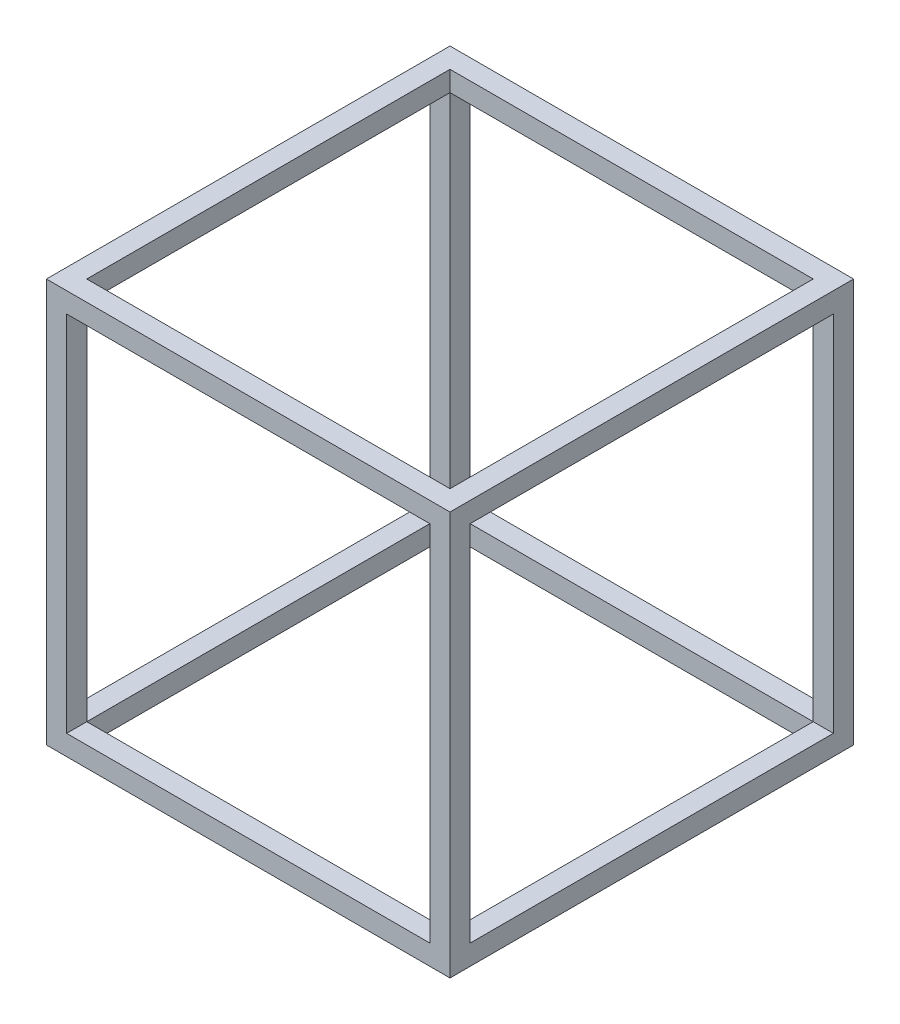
ISO-10303-21;
HEADER;
FILE_DESCRIPTION(('STEP AP214'),'2;1');
FILE_NAME('part.step','',(''),(''),'','','');
FILE_SCHEMA(('AUTOMOTIVE_DESIGN { 1 0 10303 214 1 1 1 1 }'));
ENDSEC;
DATA;
#1=APPLICATION_CONTEXT('core data for automotive mechanical design processes');
#2=APPLICATION_PROTOCOL_DEFINITION('international standard','automotive_design',2000,#1);
#3=PRODUCT_CONTEXT('',#1,'mechanical');
#4=PRODUCT('Part','Part','',(#3));
#5=PRODUCT_RELATED_PRODUCT_CATEGORY('part','',(#4));
#6=PRODUCT_DEFINITION_FORMATION('','',#4);
#7=PRODUCT_DEFINITION_CONTEXT('part definition',#1,'design');
#8=PRODUCT_DEFINITION('design','',#6,#7);
#9=PRODUCT_DEFINITION_SHAPE('','',#8);
#10=(LENGTH_UNIT() NAMED_UNIT(*) SI_UNIT(.MILLI.,.METRE.));
#11=(NAMED_UNIT(*) PLANE_ANGLE_UNIT() SI_UNIT($,.RADIAN.));
#12=(NAMED_UNIT(*) SI_UNIT($,.STERADIAN.) SOLID_ANGLE_UNIT());
#13=UNCERTAINTY_MEASURE_WITH_UNIT(LENGTH_MEASURE(1.E-05),#10,'distance_accuracy_value','');
#14=(GEOMETRIC_REPRESENTATION_CONTEXT(3) GLOBAL_UNCERTAINTY_ASSIGNED_CONTEXT((#13)) GLOBAL_UNIT_ASSIGNED_CONTEXT((#10,
#11,#12)) REPRESENTATION_CONTEXT('',''));
#15=CARTESIAN_POINT('',(0.,0.,0.));
#16=DIRECTION('',(0.,0.,1.));
#17=DIRECTION('',(1.,0.,0.));
#18=AXIS2_PLACEMENT_3D('',#15,#16,#17);
#19=CARTESIAN_POINT('',(0.,2.,-40.));
#20=DIRECTION('',(0.,-1.,0.));
#21=DIRECTION('',(0.,0.,-1.));
#22=AXIS2_PLACEMENT_3D('',#19,#20,#21);
#23=PLANE('',#22);
#24=DIRECTION('',(-1.,0.,0.));
#25=VECTOR('',#24,1.);
#26=CARTESIAN_POINT('',(2.,2.,-1.99999999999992));
#27=LINE('',#26,#25);
#28=CARTESIAN_POINT('',(2.,2.,-2.));
#29=VERTEX_POINT('',#28);
#30=CARTESIAN_POINT('',(0.,2.,-1.99999999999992));
#31=VERTEX_POINT('',#30);
#32=EDGE_CURVE('E223',#29,#31,#27,.T.);
#33=ORIENTED_EDGE('',*,*,#32,.F.);
#34=DIRECTION('',(0.,0.,-1.));
#35=VECTOR('',#34,1.);
#36=CARTESIAN_POINT('',(2.,2.,-38.));
#37=LINE('',#36,#35);
#38=CARTESIAN_POINT('',(2.,2.,-38.));
#39=VERTEX_POINT('',#38);
#40=EDGE_CURVE('E199',#29,#39,#37,.T.);
#41=ORIENTED_EDGE('',*,*,#40,.T.);
#42=DIRECTION('',(-1.,0.,0.));
#43=VECTOR('',#42,1.);
#44=CARTESIAN_POINT('',(2.,2.,-38.0000000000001));
#45=LINE('',#44,#43);
#46=CARTESIAN_POINT('',(0.,2.,-38.0000000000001));
#47=VERTEX_POINT('',#46);
#48=EDGE_CURVE('E221',#39,#47,#45,.T.);
#49=ORIENTED_EDGE('',*,*,#48,.T.);
#50=DIRECTION('',(0.,0.,1.));
#51=VECTOR('',#50,1.);
#52=CARTESIAN_POINT('',(0.,2.,-38.0000000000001));
#53=LINE('',#52,#51);
#54=EDGE_CURVE('E411',#47,#31,#53,.T.);
#55=ORIENTED_EDGE('',*,*,#54,.T.);
#56=EDGE_LOOP('',(#33,#41,#49,#55));
#57=FACE_BOUND('',#56,.T.);
#58=ADVANCED_FACE('F59',(#57),#23,.F.);
#59=DIRECTION('',(0.,0.,1.));
#60=VECTOR('',#59,1.);
#61=CARTESIAN_POINT('',(38.,2.,-40.));
#62=LINE('',#61,#60);
#63=CARTESIAN_POINT('',(38.,2.,-2.));
#64=VERTEX_POINT('',#63);
#65=CARTESIAN_POINT('',(38.,2.,0.));
#66=VERTEX_POINT('',#65);
#67=EDGE_CURVE('E251',#64,#66,#62,.T.);
#68=ORIENTED_EDGE('',*,*,#67,.F.);
#69=DIRECTION('',(-1.,0.,0.));
#70=VECTOR('',#69,1.);
#71=CARTESIAN_POINT('',(38.,2.,-2.));
#72=LINE('',#71,#70);
#73=EDGE_CURVE('E205',#64,#29,#72,.T.);
#74=ORIENTED_EDGE('',*,*,#73,.T.);
#75=DIRECTION('',(0.,0.,1.));
#76=VECTOR('',#75,1.);
#77=CARTESIAN_POINT('',(2.,2.,-40.));
#78=LINE('',#77,#76);
#79=CARTESIAN_POINT('',(2.,2.,0.));
#80=VERTEX_POINT('',#79);
#81=EDGE_CURVE('E252',#29,#80,#78,.T.);
#82=ORIENTED_EDGE('',*,*,#81,.T.);
#83=DIRECTION('',(1.,0.,0.));
#84=VECTOR('',#83,1.);
#85=CARTESIAN_POINT('',(0.,2.,0.));
#86=LINE('',#85,#84);
#87=EDGE_CURVE('E378',#80,#66,#86,.T.);
#88=ORIENTED_EDGE('',*,*,#87,.T.);
#89=EDGE_LOOP('',(#68,#74,#82,#88));
#90=FACE_BOUND('',#89,.T.);
#91=ADVANCED_FACE('F315',(#90),#23,.F.);
#92=DIRECTION('',(1.,0.,0.));
#93=VECTOR('',#92,1.);
#94=CARTESIAN_POINT('',(38.,2.00000000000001,-38.));
#95=LINE('',#94,#93);
#96=CARTESIAN_POINT('',(38.,2.,-38.));
#97=VERTEX_POINT('',#96);
#98=CARTESIAN_POINT('',(40.,2.00000000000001,-38.));
#99=VERTEX_POINT('',#98);
#100=EDGE_CURVE('E349',#97,#99,#95,.T.);
#101=ORIENTED_EDGE('',*,*,#100,.F.);
#102=DIRECTION('',(0.,0.,1.));
#103=VECTOR('',#102,1.);
#104=CARTESIAN_POINT('',(38.,2.,-38.));
#105=LINE('',#104,#103);
#106=EDGE_CURVE('E215',#97,#64,#105,.T.);
#107=ORIENTED_EDGE('',*,*,#106,.T.);
#108=DIRECTION('',(1.,0.,0.));
#109=VECTOR('',#108,1.);
#110=CARTESIAN_POINT('',(38.,2.00000000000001,-1.99999999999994));
#111=LINE('',#110,#109);
#112=CARTESIAN_POINT('',(40.,2.00000000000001,-1.99999999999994));
#113=VERTEX_POINT('',#112);
#114=EDGE_CURVE('E355',#64,#113,#111,.T.);
#115=ORIENTED_EDGE('',*,*,#114,.T.);
#116=DIRECTION('',(0.,0.,-1.));
#117=VECTOR('',#116,1.);
#118=CARTESIAN_POINT('',(40.,2.00000000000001,-1.99999999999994));
#119=LINE('',#118,#117);
#120=EDGE_CURVE('E353',#113,#99,#119,.T.);
#121=ORIENTED_EDGE('',*,*,#120,.T.);
#122=EDGE_LOOP('',(#101,#107,#115,#121));
#123=FACE_BOUND('',#122,.T.);
#124=ADVANCED_FACE('F320',(#123),#23,.F.);
#125=CARTESIAN_POINT('',(0.,38.,-40.));
#126=DIRECTION('',(0.,1.,0.));
#127=DIRECTION('',(0.,0.,1.));
#128=AXIS2_PLACEMENT_3D('',#125,#126,#127);
#129=PLANE('',#128);
#130=DIRECTION('',(-1.,0.,0.));
#131=VECTOR('',#130,1.);
#132=CARTESIAN_POINT('',(2.,38.,-38.0000000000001));
#133=LINE('',#132,#131);
#134=CARTESIAN_POINT('',(1.99999999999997,38.,-38.));
#135=VERTEX_POINT('',#134);
#136=CARTESIAN_POINT('',(0.,38.,-38.0000000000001));
#137=VERTEX_POINT('',#136);
#138=EDGE_CURVE('E236',#135,#137,#133,.T.);
#139=ORIENTED_EDGE('',*,*,#138,.F.);
#140=DIRECTION('',(0.,0.,1.));
#141=VECTOR('',#140,1.);
#142=CARTESIAN_POINT('',(1.99999999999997,38.,-38.));
#143=LINE('',#142,#141);
#144=CARTESIAN_POINT('',(1.99999999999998,38.,-2.00000000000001));
#145=VERTEX_POINT('',#144);
#146=EDGE_CURVE('E433',#135,#145,#143,.T.);
#147=ORIENTED_EDGE('',*,*,#146,.T.);
#148=DIRECTION('',(-1.,0.,0.));
#149=VECTOR('',#148,1.);
#150=CARTESIAN_POINT('',(2.,38.,-1.99999999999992));
#151=LINE('',#150,#149);
#152=CARTESIAN_POINT('',(0.,38.,-1.99999999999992));
#153=VERTEX_POINT('',#152);
#154=EDGE_CURVE('E244',#145,#153,#151,.T.);
#155=ORIENTED_EDGE('',*,*,#154,.T.);
#156=DIRECTION('',(0.,0.,-1.));
#157=VECTOR('',#156,1.);
#158=CARTESIAN_POINT('',(0.,38.,-38.0000000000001));
#159=LINE('',#158,#157);
#160=EDGE_CURVE('E414',#153,#137,#159,.T.);
#161=ORIENTED_EDGE('',*,*,#160,.T.);
#162=EDGE_LOOP('',(#139,#147,#155,#161));
#163=FACE_BOUND('',#162,.T.);
#164=ADVANCED_FACE('F338',(#163),#129,.F.);
#165=DIRECTION('',(0.,0.,1.));
#166=VECTOR('',#165,1.);
#167=CARTESIAN_POINT('',(38.,38.,-40.));
#168=LINE('',#167,#166);
#169=CARTESIAN_POINT('',(38.,38.,-40.));
#170=VERTEX_POINT('',#169);
#171=CARTESIAN_POINT('',(38.,38.,-38.));
#172=VERTEX_POINT('',#171);
#173=EDGE_CURVE('E364',#170,#172,#168,.T.);
#174=ORIENTED_EDGE('',*,*,#173,.T.);
#175=DIRECTION('',(-1.,0.,0.));
#176=VECTOR('',#175,1.);
#177=CARTESIAN_POINT('',(38.,38.,-38.));
#178=LINE('',#177,#176);
#179=EDGE_CURVE('E425',#172,#135,#178,.T.);
#180=ORIENTED_EDGE('',*,*,#179,.T.);
#181=DIRECTION('',(0.,0.,1.));
#182=VECTOR('',#181,1.);
#183=CARTESIAN_POINT('',(2.,38.,-40.));
#184=LINE('',#183,#182);
#185=CARTESIAN_POINT('',(2.,38.,-40.));
#186=VERTEX_POINT('',#185);
#187=EDGE_CURVE('E243',#186,#135,#184,.T.);
#188=ORIENTED_EDGE('',*,*,#187,.F.);
#189=DIRECTION('',(-1.,0.,0.));
#190=VECTOR('',#189,1.);
#191=CARTESIAN_POINT('',(0.,38.,-40.));
#192=LINE('',#191,#190);
#193=EDGE_CURVE('E256',#170,#186,#192,.T.);
#194=ORIENTED_EDGE('',*,*,#193,.F.);
#195=EDGE_LOOP('',(#174,#180,#188,#194));
#196=FACE_BOUND('',#195,.T.);
#197=ADVANCED_FACE('F343',(#196),#129,.F.);
#198=DIRECTION('',(1.,0.,0.));
#199=VECTOR('',#198,1.);
#200=CARTESIAN_POINT('',(38.,38.,-1.99999999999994));
#201=LINE('',#200,#199);
#202=CARTESIAN_POINT('',(38.,38.,-1.99999999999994));
#203=VERTEX_POINT('',#202);
#204=CARTESIAN_POINT('',(40.,38.,-1.99999999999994));
#205=VERTEX_POINT('',#204);
#206=EDGE_CURVE('E391',#203,#205,#201,.T.);
#207=ORIENTED_EDGE('',*,*,#206,.F.);
#208=DIRECTION('',(0.,0.,-1.));
#209=VECTOR('',#208,1.);
#210=CARTESIAN_POINT('',(38.,38.,-38.));
#211=LINE('',#210,#209);
#212=EDGE_CURVE('E444',#203,#172,#211,.T.);
#213=ORIENTED_EDGE('',*,*,#212,.T.);
#214=DIRECTION('',(1.,0.,0.));
#215=VECTOR('',#214,1.);
#216=CARTESIAN_POINT('',(38.,38.,-38.));
#217=LINE('',#216,#215);
#218=CARTESIAN_POINT('',(40.,38.,-38.));
#219=VERTEX_POINT('',#218);
#220=EDGE_CURVE('E388',#172,#219,#217,.T.);
#221=ORIENTED_EDGE('',*,*,#220,.T.);
#222=DIRECTION('',(0.,0.,1.));
#223=VECTOR('',#222,1.);
#224=CARTESIAN_POINT('',(40.,38.,-1.99999999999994));
#225=LINE('',#224,#223);
#226=EDGE_CURVE('E399',#219,#205,#225,.T.);
#227=ORIENTED_EDGE('',*,*,#226,.T.);
#228=EDGE_LOOP('',(#207,#213,#221,#227));
#229=FACE_BOUND('',#228,.T.);
#230=ADVANCED_FACE('F487',(#229),#129,.F.);
#231=CARTESIAN_POINT('',(2.,0.,-40.));
#232=DIRECTION('',(-1.,0.,0.));
#233=DIRECTION('',(0.,0.,1.));
#234=AXIS2_PLACEMENT_3D('',#231,#232,#233);
#235=PLANE('',#234);
#236=ORIENTED_EDGE('',*,*,#81,.F.);
#237=DIRECTION('',(0.,1.,0.));
#238=VECTOR('',#237,1.);
#239=CARTESIAN_POINT('',(2.,2.,-1.99999999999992));
#240=LINE('',#239,#238);
#241=EDGE_CURVE('E245',#29,#145,#240,.T.);
#242=ORIENTED_EDGE('',*,*,#241,.T.);
#243=CARTESIAN_POINT('',(2.,38.,0.));
#244=VERTEX_POINT('',#243);
#245=EDGE_CURVE('E370',#145,#244,#184,.T.);
#246=ORIENTED_EDGE('',*,*,#245,.T.);
#247=DIRECTION('',(0.,-1.,0.));
#248=VECTOR('',#247,1.);
#249=CARTESIAN_POINT('',(2.,0.,0.));
#250=LINE('',#249,#248);
#251=EDGE_CURVE('E354',#244,#80,#250,.T.);
#252=ORIENTED_EDGE('',*,*,#251,.T.);
#253=EDGE_LOOP('',(#236,#242,#246,#252));
#254=FACE_BOUND('',#253,.T.);
#255=ADVANCED_FACE('F473',(#254),#235,.F.);
#256=CARTESIAN_POINT('',(38.,0.,-40.));
#257=DIRECTION('',(1.,0.,0.));
#258=DIRECTION('',(0.,0.,-1.));
#259=AXIS2_PLACEMENT_3D('',#256,#257,#258);
#260=PLANE('',#259);
#261=CARTESIAN_POINT('',(38.,2.,-40.));
#262=VERTEX_POINT('',#261);
#263=EDGE_CURVE('E254',#262,#97,#62,.T.);
#264=ORIENTED_EDGE('',*,*,#263,.T.);
#265=DIRECTION('',(0.,1.,0.));
#266=VECTOR('',#265,1.);
#267=CARTESIAN_POINT('',(38.,2.00000000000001,-38.));
#268=LINE('',#267,#266);
#269=EDGE_CURVE('E359',#97,#172,#268,.T.);
#270=ORIENTED_EDGE('',*,*,#269,.T.);
#271=ORIENTED_EDGE('',*,*,#173,.F.);
#272=DIRECTION('',(0.,1.,0.));
#273=VECTOR('',#272,1.);
#274=CARTESIAN_POINT('',(38.,0.,-40.));
#275=LINE('',#274,#273);
#276=EDGE_CURVE('E362',#262,#170,#275,.T.);
#277=ORIENTED_EDGE('',*,*,#276,.F.);
#278=EDGE_LOOP('',(#264,#270,#271,#277));
#279=FACE_BOUND('',#278,.T.);
#280=ADVANCED_FACE('F336',(#279),#260,.F.);
#281=CARTESIAN_POINT('',(0.,0.,-40.));
#282=DIRECTION('',(-1.,0.,0.));
#283=DIRECTION('',(0.,0.,1.));
#284=AXIS2_PLACEMENT_3D('',#281,#282,#283);
#285=PLANE('',#284);
#286=DIRECTION('',(0.,1.,0.));
#287=VECTOR('',#286,1.);
#288=CARTESIAN_POINT('',(0.,2.,-1.99999999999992));
#289=LINE('',#288,#287);
#290=EDGE_CURVE('E417',#31,#153,#289,.T.);
#291=ORIENTED_EDGE('',*,*,#290,.F.);
#292=ORIENTED_EDGE('',*,*,#54,.F.);
#293=DIRECTION('',(0.,-1.,0.));
#294=VECTOR('',#293,1.);
#295=CARTESIAN_POINT('',(0.,2.,-38.0000000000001));
#296=LINE('',#295,#294);
#297=EDGE_CURVE('E234',#137,#47,#296,.T.);
#298=ORIENTED_EDGE('',*,*,#297,.F.);
#299=ORIENTED_EDGE('',*,*,#160,.F.);
#300=EDGE_LOOP('',(#291,#292,#298,#299));
#301=FACE_BOUND('',#300,.T.);
#302=DIRECTION('',(0.,-1.,0.));
#303=VECTOR('',#302,1.);
#304=CARTESIAN_POINT('',(0.,0.,0.));
#305=LINE('',#304,#303);
#306=CARTESIAN_POINT('',(0.,40.,0.));
#307=VERTEX_POINT('',#306);
#308=CARTESIAN_POINT('',(0.,0.,0.));
#309=VERTEX_POINT('',#308);
#310=EDGE_CURVE('E272',#307,#309,#305,.T.);
#311=ORIENTED_EDGE('',*,*,#310,.F.);
#312=DIRECTION('',(0.,0.,1.));
#313=VECTOR('',#312,1.);
#314=CARTESIAN_POINT('',(0.,40.,-40.));
#315=LINE('',#314,#313);
#316=CARTESIAN_POINT('',(0.,40.,-40.));
#317=VERTEX_POINT('',#316);
#318=EDGE_CURVE('E12',#317,#307,#315,.T.);
#319=ORIENTED_EDGE('',*,*,#318,.F.);
#320=DIRECTION('',(0.,-1.,0.));
#321=VECTOR('',#320,1.);
#322=CARTESIAN_POINT('',(0.,0.,-40.));
#323=LINE('',#322,#321);
#324=CARTESIAN_POINT('',(0.,0.,-40.));
#325=VERTEX_POINT('',#324);
#326=EDGE_CURVE('E259',#317,#325,#323,.T.);
#327=ORIENTED_EDGE('',*,*,#326,.T.);
#328=DIRECTION('',(0.,0.,1.));
#329=VECTOR('',#328,1.);
#330=CARTESIAN_POINT('',(0.,0.,-40.));
#331=LINE('',#330,#329);
#332=EDGE_CURVE('E63',#325,#309,#331,.T.);
#333=ORIENTED_EDGE('',*,*,#332,.T.);
#334=EDGE_LOOP('',(#311,#319,#327,#333));
#335=FACE_BOUND('',#334,.T.);
#336=ADVANCED_FACE('F61',(#301,#335),#285,.T.);
#337=CARTESIAN_POINT('',(0.,40.,-40.));
#338=DIRECTION('',(0.,1.,0.));
#339=DIRECTION('',(0.,0.,1.));
#340=AXIS2_PLACEMENT_3D('',#337,#338,#339);
#341=PLANE('',#340);
#342=DIRECTION('',(0.,0.,1.));
#343=VECTOR('',#342,1.);
#344=CARTESIAN_POINT('',(1.99999999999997,40.,-38.));
#345=LINE('',#344,#343);
#346=CARTESIAN_POINT('',(1.99999999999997,40.,-38.));
#347=VERTEX_POINT('',#346);
#348=CARTESIAN_POINT('',(1.99999999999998,40.,-2.));
#349=VERTEX_POINT('',#348);
#350=EDGE_CURVE('E84',#347,#349,#345,.T.);
#351=ORIENTED_EDGE('',*,*,#350,.F.);
#352=DIRECTION('',(-1.,0.,0.));
#353=VECTOR('',#352,1.);
#354=CARTESIAN_POINT('',(38.,40.,-38.));
#355=LINE('',#354,#353);
#356=CARTESIAN_POINT('',(38.,40.,-38.));
#357=VERTEX_POINT('',#356);
#358=EDGE_CURVE('E430',#357,#347,#355,.T.);
#359=ORIENTED_EDGE('',*,*,#358,.F.);
#360=DIRECTION('',(0.,0.,-1.));
#361=VECTOR('',#360,1.);
#362=CARTESIAN_POINT('',(38.,40.,-38.));
#363=LINE('',#362,#361);
#364=CARTESIAN_POINT('',(38.,40.,-2.00000000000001));
#365=VERTEX_POINT('',#364);
#366=EDGE_CURVE('E434',#365,#357,#363,.T.);
#367=ORIENTED_EDGE('',*,*,#366,.F.);
#368=DIRECTION('',(1.,0.,0.));
#369=VECTOR('',#368,1.);
#370=CARTESIAN_POINT('',(38.,40.,-2.00000000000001));
#371=LINE('',#370,#369);
#372=EDGE_CURVE('E437',#349,#365,#371,.T.);
#373=ORIENTED_EDGE('',*,*,#372,.F.);
#374=EDGE_LOOP('',(#351,#359,#367,#373));
#375=FACE_BOUND('',#374,.T.);
#376=DIRECTION('',(-1.,0.,0.));
#377=VECTOR('',#376,1.);
#378=CARTESIAN_POINT('',(0.,40.,0.));
#379=LINE('',#378,#377);
#380=CARTESIAN_POINT('',(40.,40.,0.));
#381=VERTEX_POINT('',#380);
#382=EDGE_CURVE('E263',#381,#307,#379,.T.);
#383=ORIENTED_EDGE('',*,*,#382,.F.);
#384=DIRECTION('',(0.,0.,1.));
#385=VECTOR('',#384,1.);
#386=CARTESIAN_POINT('',(40.,40.,-40.));
#387=LINE('',#386,#385);
#388=CARTESIAN_POINT('',(40.,40.,-40.));
#389=VERTEX_POINT('',#388);
#390=EDGE_CURVE('E68',#389,#381,#387,.T.);
#391=ORIENTED_EDGE('',*,*,#390,.F.);
#392=DIRECTION('',(-1.,0.,0.));
#393=VECTOR('',#392,1.);
#394=CARTESIAN_POINT('',(0.,40.,-40.));
#395=LINE('',#394,#393);
#396=EDGE_CURVE('E269',#389,#317,#395,.T.);
#397=ORIENTED_EDGE('',*,*,#396,.T.);
#398=ORIENTED_EDGE('',*,*,#318,.T.);
#399=EDGE_LOOP('',(#383,#391,#397,#398));
#400=FACE_BOUND('',#399,.T.);
#401=ADVANCED_FACE('F296',(#375,#400),#341,.T.);
#402=CARTESIAN_POINT('',(40.,0.,-40.));
#403=DIRECTION('',(1.,0.,0.));
#404=DIRECTION('',(0.,0.,-1.));
#405=AXIS2_PLACEMENT_3D('',#402,#403,#404);
#406=PLANE('',#405);
#407=DIRECTION('',(0.,1.,0.));
#408=VECTOR('',#407,1.);
#409=CARTESIAN_POINT('',(40.,2.00000000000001,-38.));
#410=LINE('',#409,#408);
#411=EDGE_CURVE('E402',#99,#219,#410,.T.);
#412=ORIENTED_EDGE('',*,*,#411,.F.);
#413=ORIENTED_EDGE('',*,*,#120,.F.);
#414=DIRECTION('',(0.,-1.,0.));
#415=VECTOR('',#414,1.);
#416=CARTESIAN_POINT('',(40.,2.00000000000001,-1.99999999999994));
#417=LINE('',#416,#415);
#418=EDGE_CURVE('E396',#205,#113,#417,.T.);
#419=ORIENTED_EDGE('',*,*,#418,.F.);
#420=ORIENTED_EDGE('',*,*,#226,.F.);
#421=EDGE_LOOP('',(#412,#413,#419,#420));
#422=FACE_BOUND('',#421,.T.);
#423=DIRECTION('',(0.,1.,0.));
#424=VECTOR('',#423,1.);
#425=CARTESIAN_POINT('',(40.,0.,0.));
#426=LINE('',#425,#424);
#427=CARTESIAN_POINT('',(40.,0.,0.));
#428=VERTEX_POINT('',#427);
#429=EDGE_CURVE('E278',#428,#381,#426,.T.);
#430=ORIENTED_EDGE('',*,*,#429,.F.);
#431=DIRECTION('',(0.,0.,1.));
#432=VECTOR('',#431,1.);
#433=CARTESIAN_POINT('',(40.,0.,-40.));
#434=LINE('',#433,#432);
#435=CARTESIAN_POINT('',(40.,0.,-40.));
#436=VERTEX_POINT('',#435);
#437=EDGE_CURVE('E283',#436,#428,#434,.T.);
#438=ORIENTED_EDGE('',*,*,#437,.F.);
#439=DIRECTION('',(0.,1.,0.));
#440=VECTOR('',#439,1.);
#441=CARTESIAN_POINT('',(40.,0.,-40.));
#442=LINE('',#441,#440);
#443=EDGE_CURVE('E266',#436,#389,#442,.T.);
#444=ORIENTED_EDGE('',*,*,#443,.T.);
#445=ORIENTED_EDGE('',*,*,#390,.T.);
#446=EDGE_LOOP('',(#430,#438,#444,#445));
#447=FACE_BOUND('',#446,.T.);
#448=ADVANCED_FACE('F302',(#422,#447),#406,.T.);
#449=CARTESIAN_POINT('',(0.,0.,-40.));
#450=DIRECTION('',(0.,-1.,0.));
#451=DIRECTION('',(0.,0.,-1.));
#452=AXIS2_PLACEMENT_3D('',#449,#450,#451);
#453=PLANE('',#452);
#454=DIRECTION('',(0.,0.,-1.));
#455=VECTOR('',#454,1.);
#456=CARTESIAN_POINT('',(2.,0.,-38.));
#457=LINE('',#456,#455);
#458=CARTESIAN_POINT('',(2.,0.,-2.));
#459=VERTEX_POINT('',#458);
#460=CARTESIAN_POINT('',(2.,0.,-38.));
#461=VERTEX_POINT('',#460);
#462=EDGE_CURVE('E76',#459,#461,#457,.T.);
#463=ORIENTED_EDGE('',*,*,#462,.F.);
#464=DIRECTION('',(-1.,0.,0.));
#465=VECTOR('',#464,1.);
#466=CARTESIAN_POINT('',(38.,0.,-2.));
#467=LINE('',#466,#465);
#468=CARTESIAN_POINT('',(38.,0.,-2.));
#469=VERTEX_POINT('',#468);
#470=EDGE_CURVE('E225',#469,#459,#467,.T.);
#471=ORIENTED_EDGE('',*,*,#470,.F.);
#472=DIRECTION('',(0.,0.,1.));
#473=VECTOR('',#472,1.);
#474=CARTESIAN_POINT('',(38.,0.,-38.));
#475=LINE('',#474,#473);
#476=CARTESIAN_POINT('',(38.,0.,-38.));
#477=VERTEX_POINT('',#476);
#478=EDGE_CURVE('E457',#477,#469,#475,.T.);
#479=ORIENTED_EDGE('',*,*,#478,.F.);
#480=DIRECTION('',(1.,0.,0.));
#481=VECTOR('',#480,1.);
#482=CARTESIAN_POINT('',(38.,0.,-38.));
#483=LINE('',#482,#481);
#484=EDGE_CURVE('E460',#461,#477,#483,.T.);
#485=ORIENTED_EDGE('',*,*,#484,.F.);
#486=EDGE_LOOP('',(#463,#471,#479,#485));
#487=FACE_BOUND('',#486,.T.);
#488=DIRECTION('',(1.,0.,0.));
#489=VECTOR('',#488,1.);
#490=CARTESIAN_POINT('',(0.,0.,0.));
#491=LINE('',#490,#489);
#492=EDGE_CURVE('E275',#309,#428,#491,.T.);
#493=ORIENTED_EDGE('',*,*,#492,.F.);
#494=ORIENTED_EDGE('',*,*,#332,.F.);
#495=DIRECTION('',(1.,0.,0.));
#496=VECTOR('',#495,1.);
#497=CARTESIAN_POINT('',(0.,0.,-40.));
#498=LINE('',#497,#496);
#499=EDGE_CURVE('E262',#325,#436,#498,.T.);
#500=ORIENTED_EDGE('',*,*,#499,.T.);
#501=ORIENTED_EDGE('',*,*,#437,.T.);
#502=EDGE_LOOP('',(#493,#494,#500,#501));
#503=FACE_BOUND('',#502,.T.);
#504=ADVANCED_FACE('F291',(#487,#503),#453,.T.);
#505=CARTESIAN_POINT('',(0.,0.,-40.));
#506=DIRECTION('',(0.,0.,1.));
#507=DIRECTION('',(1.,0.,0.));
#508=AXIS2_PLACEMENT_3D('',#505,#506,#507);
#509=PLANE('',#508);
#510=ORIENTED_EDGE('',*,*,#193,.T.);
#511=DIRECTION('',(0.,-1.,0.));
#512=VECTOR('',#511,1.);
#513=CARTESIAN_POINT('',(2.,0.,-40.));
#514=LINE('',#513,#512);
#515=CARTESIAN_POINT('',(2.,2.,-40.));
#516=VERTEX_POINT('',#515);
#517=EDGE_CURVE('E375',#186,#516,#514,.T.);
#518=ORIENTED_EDGE('',*,*,#517,.T.);
#519=DIRECTION('',(1.,0.,0.));
#520=VECTOR('',#519,1.);
#521=CARTESIAN_POINT('',(0.,2.,-40.));
#522=LINE('',#521,#520);
#523=EDGE_CURVE('E249',#516,#262,#522,.T.);
#524=ORIENTED_EDGE('',*,*,#523,.T.);
#525=ORIENTED_EDGE('',*,*,#276,.T.);
#526=EDGE_LOOP('',(#510,#518,#524,#525));
#527=FACE_BOUND('',#526,.T.);
#528=ORIENTED_EDGE('',*,*,#326,.F.);
#529=ORIENTED_EDGE('',*,*,#396,.F.);
#530=ORIENTED_EDGE('',*,*,#443,.F.);
#531=ORIENTED_EDGE('',*,*,#499,.F.);
#532=EDGE_LOOP('',(#528,#529,#530,#531));
#533=FACE_BOUND('',#532,.T.);
#534=ADVANCED_FACE('F299',(#527,#533),#509,.F.);
#535=CARTESIAN_POINT('',(0.,0.,0.));
#536=DIRECTION('',(0.,0.,1.));
#537=DIRECTION('',(1.,0.,0.));
#538=AXIS2_PLACEMENT_3D('',#535,#536,#537);
#539=PLANE('',#538);
#540=ORIENTED_EDGE('',*,*,#251,.F.);
#541=DIRECTION('',(-1.,0.,0.));
#542=VECTOR('',#541,1.);
#543=CARTESIAN_POINT('',(0.,38.,0.));
#544=LINE('',#543,#542);
#545=CARTESIAN_POINT('',(38.,38.,0.));
#546=VERTEX_POINT('',#545);
#547=EDGE_CURVE('E373',#546,#244,#544,.T.);
#548=ORIENTED_EDGE('',*,*,#547,.F.);
#549=DIRECTION('',(0.,1.,0.));
#550=VECTOR('',#549,1.);
#551=CARTESIAN_POINT('',(38.,0.,0.));
#552=LINE('',#551,#550);
#553=EDGE_CURVE('E376',#66,#546,#552,.T.);
#554=ORIENTED_EDGE('',*,*,#553,.F.);
#555=ORIENTED_EDGE('',*,*,#87,.F.);
#556=EDGE_LOOP('',(#540,#548,#554,#555));
#557=FACE_BOUND('',#556,.T.);
#558=ORIENTED_EDGE('',*,*,#310,.T.);
#559=ORIENTED_EDGE('',*,*,#492,.T.);
#560=ORIENTED_EDGE('',*,*,#429,.T.);
#561=ORIENTED_EDGE('',*,*,#382,.T.);
#562=EDGE_LOOP('',(#558,#559,#560,#561));
#563=FACE_BOUND('',#562,.T.);
#564=ADVANCED_FACE('F293',(#557,#563),#539,.T.);
#565=ORIENTED_EDGE('',*,*,#187,.T.);
#566=DIRECTION('',(0.,-1.,0.));
#567=VECTOR('',#566,1.);
#568=CARTESIAN_POINT('',(2.,2.,-38.0000000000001));
#569=LINE('',#568,#567);
#570=EDGE_CURVE('E231',#135,#39,#569,.T.);
#571=ORIENTED_EDGE('',*,*,#570,.T.);
#572=EDGE_CURVE('E241',#516,#39,#78,.T.);
#573=ORIENTED_EDGE('',*,*,#572,.F.);
#574=ORIENTED_EDGE('',*,*,#517,.F.);
#575=EDGE_LOOP('',(#565,#571,#573,#574));
#576=FACE_BOUND('',#575,.T.);
#577=ADVANCED_FACE('F239',(#576),#235,.F.);
#578=ORIENTED_EDGE('',*,*,#245,.F.);
#579=DIRECTION('',(1.,0.,0.));
#580=VECTOR('',#579,1.);
#581=CARTESIAN_POINT('',(38.,38.,-2.00000000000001));
#582=LINE('',#581,#580);
#583=EDGE_CURVE('E447',#145,#203,#582,.T.);
#584=ORIENTED_EDGE('',*,*,#583,.T.);
#585=EDGE_CURVE('E363',#203,#546,#168,.T.);
#586=ORIENTED_EDGE('',*,*,#585,.T.);
#587=ORIENTED_EDGE('',*,*,#547,.T.);
#588=EDGE_LOOP('',(#578,#584,#586,#587));
#589=FACE_BOUND('',#588,.T.);
#590=ADVANCED_FACE('F334',(#589),#129,.F.);
#591=ORIENTED_EDGE('',*,*,#585,.F.);
#592=DIRECTION('',(0.,-1.,0.));
#593=VECTOR('',#592,1.);
#594=CARTESIAN_POINT('',(38.,2.00000000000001,-1.99999999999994));
#595=LINE('',#594,#593);
#596=EDGE_CURVE('E392',#203,#64,#595,.T.);
#597=ORIENTED_EDGE('',*,*,#596,.T.);
#598=ORIENTED_EDGE('',*,*,#67,.T.);
#599=ORIENTED_EDGE('',*,*,#553,.T.);
#600=EDGE_LOOP('',(#591,#597,#598,#599));
#601=FACE_BOUND('',#600,.T.);
#602=ADVANCED_FACE('F326',(#601),#260,.F.);
#603=ORIENTED_EDGE('',*,*,#572,.T.);
#604=DIRECTION('',(1.,0.,0.));
#605=VECTOR('',#604,1.);
#606=CARTESIAN_POINT('',(38.,2.,-38.));
#607=LINE('',#606,#605);
#608=EDGE_CURVE('E209',#39,#97,#607,.T.);
#609=ORIENTED_EDGE('',*,*,#608,.T.);
#610=ORIENTED_EDGE('',*,*,#263,.F.);
#611=ORIENTED_EDGE('',*,*,#523,.F.);
#612=EDGE_LOOP('',(#603,#609,#610,#611));
#613=FACE_BOUND('',#612,.T.);
#614=ADVANCED_FACE('F247',(#613),#23,.F.);
#615=CARTESIAN_POINT('',(38.,2.00000000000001,-38.));
#616=DIRECTION('',(0.,0.,-1.));
#617=DIRECTION('',(-1.,0.,0.));
#618=AXIS2_PLACEMENT_3D('',#615,#616,#617);
#619=PLANE('',#618);
#620=ORIENTED_EDGE('',*,*,#411,.T.);
#621=ORIENTED_EDGE('',*,*,#220,.F.);
#622=ORIENTED_EDGE('',*,*,#269,.F.);
#623=ORIENTED_EDGE('',*,*,#100,.T.);
#624=EDGE_LOOP('',(#620,#621,#622,#623));
#625=FACE_BOUND('',#624,.T.);
#626=ADVANCED_FACE('F325',(#625),#619,.F.);
#627=CARTESIAN_POINT('',(38.,2.00000000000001,-1.99999999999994));
#628=DIRECTION('',(0.,0.,1.));
#629=DIRECTION('',(0.,-1.,0.));
#630=AXIS2_PLACEMENT_3D('',#627,#628,#629);
#631=PLANE('',#630);
#632=ORIENTED_EDGE('',*,*,#418,.T.);
#633=ORIENTED_EDGE('',*,*,#114,.F.);
#634=ORIENTED_EDGE('',*,*,#596,.F.);
#635=ORIENTED_EDGE('',*,*,#206,.T.);
#636=EDGE_LOOP('',(#632,#633,#634,#635));
#637=FACE_BOUND('',#636,.T.);
#638=ADVANCED_FACE('F331',(#637),#631,.F.);
#639=CARTESIAN_POINT('',(2.,2.,-1.99999999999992));
#640=DIRECTION('',(0.,0.,1.));
#641=DIRECTION('',(0.,-1.,0.));
#642=AXIS2_PLACEMENT_3D('',#639,#640,#641);
#643=PLANE('',#642);
#644=ORIENTED_EDGE('',*,*,#290,.T.);
#645=ORIENTED_EDGE('',*,*,#154,.F.);
#646=ORIENTED_EDGE('',*,*,#241,.F.);
#647=ORIENTED_EDGE('',*,*,#32,.T.);
#648=EDGE_LOOP('',(#644,#645,#646,#647));
#649=FACE_BOUND('',#648,.T.);
#650=ADVANCED_FACE('F470',(#649),#643,.F.);
#651=CARTESIAN_POINT('',(2.,2.,-38.0000000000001));
#652=DIRECTION('',(0.,0.,-1.));
#653=DIRECTION('',(-1.,0.,0.));
#654=AXIS2_PLACEMENT_3D('',#651,#652,#653);
#655=PLANE('',#654);
#656=ORIENTED_EDGE('',*,*,#297,.T.);
#657=ORIENTED_EDGE('',*,*,#48,.F.);
#658=ORIENTED_EDGE('',*,*,#570,.F.);
#659=ORIENTED_EDGE('',*,*,#138,.T.);
#660=EDGE_LOOP('',(#656,#657,#658,#659));
#661=FACE_BOUND('',#660,.T.);
#662=ADVANCED_FACE('F230',(#661),#655,.F.);
#663=CARTESIAN_POINT('',(1.99999999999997,38.,-38.));
#664=DIRECTION('',(-1.,0.,0.));
#665=DIRECTION('',(0.,0.,1.));
#666=AXIS2_PLACEMENT_3D('',#663,#664,#665);
#667=PLANE('',#666);
#668=ORIENTED_EDGE('',*,*,#350,.T.);
#669=DIRECTION('',(0.,1.,0.));
#670=VECTOR('',#669,1.);
#671=CARTESIAN_POINT('',(1.99999999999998,38.,-2.00000000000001));
#672=LINE('',#671,#670);
#673=EDGE_CURVE('E422',#145,#349,#672,.T.);
#674=ORIENTED_EDGE('',*,*,#673,.F.);
#675=ORIENTED_EDGE('',*,*,#146,.F.);
#676=DIRECTION('',(0.,1.,0.));
#677=VECTOR('',#676,1.);
#678=CARTESIAN_POINT('',(1.99999999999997,38.,-38.));
#679=LINE('',#678,#677);
#680=EDGE_CURVE('E418',#135,#347,#679,.T.);
#681=ORIENTED_EDGE('',*,*,#680,.T.);
#682=EDGE_LOOP('',(#668,#674,#675,#681));
#683=FACE_BOUND('',#682,.T.);
#684=ADVANCED_FACE('F521',(#683),#667,.F.);
#685=CARTESIAN_POINT('',(38.,38.,-38.));
#686=DIRECTION('',(0.,0.,-1.));
#687=DIRECTION('',(-1.,0.,0.));
#688=AXIS2_PLACEMENT_3D('',#685,#686,#687);
#689=PLANE('',#688);
#690=ORIENTED_EDGE('',*,*,#358,.T.);
#691=ORIENTED_EDGE('',*,*,#680,.F.);
#692=ORIENTED_EDGE('',*,*,#179,.F.);
#693=DIRECTION('',(0.,1.,0.));
#694=VECTOR('',#693,1.);
#695=CARTESIAN_POINT('',(38.,38.,-38.));
#696=LINE('',#695,#694);
#697=EDGE_CURVE('E427',#172,#357,#696,.T.);
#698=ORIENTED_EDGE('',*,*,#697,.T.);
#699=EDGE_LOOP('',(#690,#691,#692,#698));
#700=FACE_BOUND('',#699,.T.);
#701=ADVANCED_FACE('F498',(#700),#689,.F.);
#702=CARTESIAN_POINT('',(38.,38.,-38.));
#703=DIRECTION('',(1.,0.,0.));
#704=DIRECTION('',(0.,0.,-1.));
#705=AXIS2_PLACEMENT_3D('',#702,#703,#704);
#706=PLANE('',#705);
#707=ORIENTED_EDGE('',*,*,#366,.T.);
#708=ORIENTED_EDGE('',*,*,#697,.F.);
#709=ORIENTED_EDGE('',*,*,#212,.F.);
#710=DIRECTION('',(0.,1.,0.));
#711=VECTOR('',#710,1.);
#712=CARTESIAN_POINT('',(38.,38.,-2.00000000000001));
#713=LINE('',#712,#711);
#714=EDGE_CURVE('E424',#203,#365,#713,.T.);
#715=ORIENTED_EDGE('',*,*,#714,.T.);
#716=EDGE_LOOP('',(#707,#708,#709,#715));
#717=FACE_BOUND('',#716,.T.);
#718=ADVANCED_FACE('F490',(#717),#706,.F.);
#719=CARTESIAN_POINT('',(38.,38.,-2.00000000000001));
#720=DIRECTION('',(0.,0.,1.));
#721=DIRECTION('',(1.,0.,0.));
#722=AXIS2_PLACEMENT_3D('',#719,#720,#721);
#723=PLANE('',#722);
#724=ORIENTED_EDGE('',*,*,#372,.T.);
#725=ORIENTED_EDGE('',*,*,#714,.F.);
#726=ORIENTED_EDGE('',*,*,#583,.F.);
#727=ORIENTED_EDGE('',*,*,#673,.T.);
#728=EDGE_LOOP('',(#724,#725,#726,#727));
#729=FACE_BOUND('',#728,.T.);
#730=ADVANCED_FACE('F493',(#729),#723,.F.);
#731=CARTESIAN_POINT('',(2.,2.,-38.));
#732=DIRECTION('',(-1.,0.,0.));
#733=DIRECTION('',(0.,0.,1.));
#734=AXIS2_PLACEMENT_3D('',#731,#732,#733);
#735=PLANE('',#734);
#736=ORIENTED_EDGE('',*,*,#462,.T.);
#737=DIRECTION('',(0.,-1.,0.));
#738=VECTOR('',#737,1.);
#739=CARTESIAN_POINT('',(2.,2.,-38.));
#740=LINE('',#739,#738);
#741=EDGE_CURVE('E195',#39,#461,#740,.T.);
#742=ORIENTED_EDGE('',*,*,#741,.F.);
#743=ORIENTED_EDGE('',*,*,#40,.F.);
#744=DIRECTION('',(0.,-1.,0.));
#745=VECTOR('',#744,1.);
#746=CARTESIAN_POINT('',(2.,2.,-2.));
#747=LINE('',#746,#745);
#748=EDGE_CURVE('E441',#29,#459,#747,.T.);
#749=ORIENTED_EDGE('',*,*,#748,.T.);
#750=EDGE_LOOP('',(#736,#742,#743,#749));
#751=FACE_BOUND('',#750,.T.);
#752=ADVANCED_FACE('F197',(#751),#735,.F.);
#753=CARTESIAN_POINT('',(38.,2.,-2.));
#754=DIRECTION('',(0.,0.,1.));
#755=DIRECTION('',(1.,0.,0.));
#756=AXIS2_PLACEMENT_3D('',#753,#754,#755);
#757=PLANE('',#756);
#758=ORIENTED_EDGE('',*,*,#470,.T.);
#759=ORIENTED_EDGE('',*,*,#748,.F.);
#760=ORIENTED_EDGE('',*,*,#73,.F.);
#761=DIRECTION('',(0.,-1.,0.));
#762=VECTOR('',#761,1.);
#763=CARTESIAN_POINT('',(38.,2.,-2.));
#764=LINE('',#763,#762);
#765=EDGE_CURVE('E452',#64,#469,#764,.T.);
#766=ORIENTED_EDGE('',*,*,#765,.T.);
#767=EDGE_LOOP('',(#758,#759,#760,#766));
#768=FACE_BOUND('',#767,.T.);
#769=ADVANCED_FACE('F532',(#768),#757,.F.);
#770=CARTESIAN_POINT('',(38.,2.,-38.));
#771=DIRECTION('',(1.,0.,0.));
#772=DIRECTION('',(0.,0.,-1.));
#773=AXIS2_PLACEMENT_3D('',#770,#771,#772);
#774=PLANE('',#773);
#775=ORIENTED_EDGE('',*,*,#478,.T.);
#776=ORIENTED_EDGE('',*,*,#765,.F.);
#777=ORIENTED_EDGE('',*,*,#106,.F.);
#778=DIRECTION('',(0.,-1.,0.));
#779=VECTOR('',#778,1.);
#780=CARTESIAN_POINT('',(38.,2.,-38.));
#781=LINE('',#780,#779);
#782=EDGE_CURVE('E204',#97,#477,#781,.T.);
#783=ORIENTED_EDGE('',*,*,#782,.T.);
#784=EDGE_LOOP('',(#775,#776,#777,#783));
#785=FACE_BOUND('',#784,.T.);
#786=ADVANCED_FACE('F535',(#785),#774,.F.);
#787=CARTESIAN_POINT('',(38.,2.,-38.));
#788=DIRECTION('',(0.,0.,-1.));
#789=DIRECTION('',(-1.,0.,0.));
#790=AXIS2_PLACEMENT_3D('',#787,#788,#789);
#791=PLANE('',#790);
#792=ORIENTED_EDGE('',*,*,#484,.T.);
#793=ORIENTED_EDGE('',*,*,#782,.F.);
#794=ORIENTED_EDGE('',*,*,#608,.F.);
#795=ORIENTED_EDGE('',*,*,#741,.T.);
#796=EDGE_LOOP('',(#792,#793,#794,#795));
#797=FACE_BOUND('',#796,.T.);
#798=ADVANCED_FACE('F210',(#797),#791,.F.);
#799=CLOSED_SHELL('',(#58,#91,#124,#164,#197,#230,#255,#280,#336,#401,#448,#504,#534,#564,#577,
#590,#602,#614,#626,#638,#650,#662,#684,#701,#718,#730,#752,#769,#786,#798));
#800=MANIFOLD_SOLID_BREP('B2',#799);
#801=ADVANCED_BREP_SHAPE_REPRESENTATION('',(#18,#800),#14);
#802=SHAPE_DEFINITION_REPRESENTATION(#9,#801);
ENDSEC;
END-ISO-10303-21;
